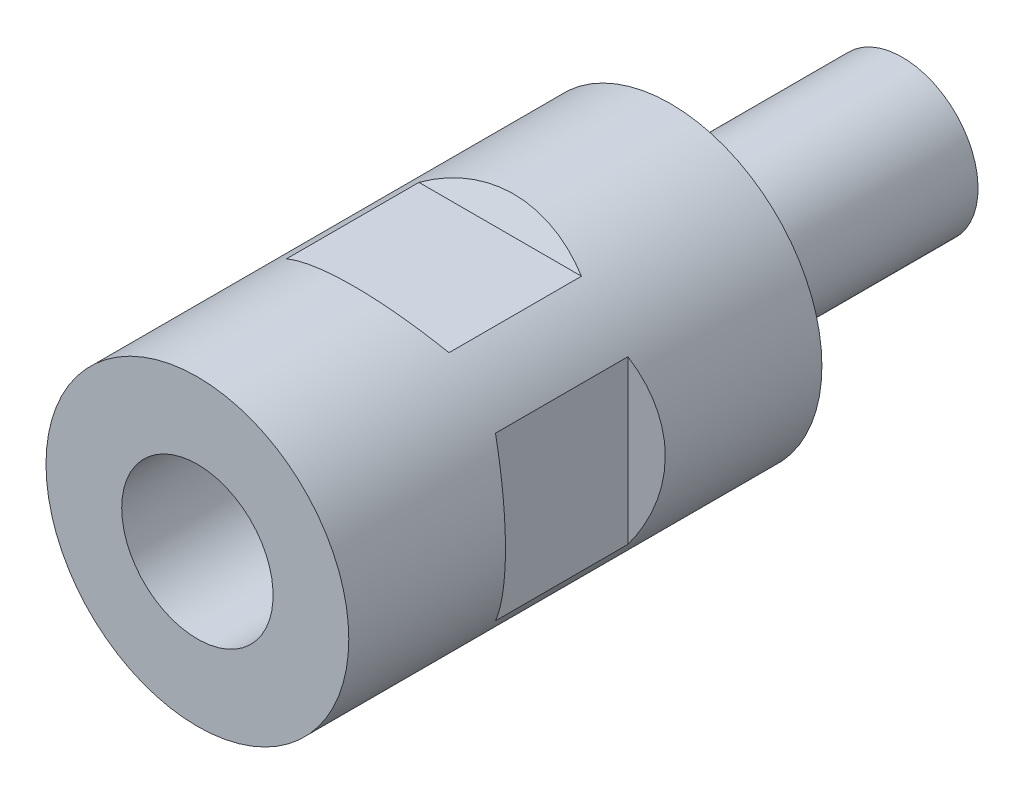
ISO-10303-21;
HEADER;
FILE_DESCRIPTION(('STEP AP214'),'2;1');
FILE_NAME('part.step','',(''),(''),'','','');
FILE_SCHEMA(('AUTOMOTIVE_DESIGN { 1 0 10303 214 1 1 1 1 }'));
ENDSEC;
DATA;
#1=APPLICATION_CONTEXT('core data for automotive mechanical design processes');
#2=APPLICATION_PROTOCOL_DEFINITION('international standard','automotive_design',2000,#1);
#3=PRODUCT_CONTEXT('',#1,'mechanical');
#4=PRODUCT('Part','Part','',(#3));
#5=PRODUCT_RELATED_PRODUCT_CATEGORY('part','',(#4));
#6=PRODUCT_DEFINITION_FORMATION('','',#4);
#7=PRODUCT_DEFINITION_CONTEXT('part definition',#1,'design');
#8=PRODUCT_DEFINITION('design','',#6,#7);
#9=PRODUCT_DEFINITION_SHAPE('','',#8);
#10=(LENGTH_UNIT() NAMED_UNIT(*) SI_UNIT(.MILLI.,.METRE.));
#11=(NAMED_UNIT(*) PLANE_ANGLE_UNIT() SI_UNIT($,.RADIAN.));
#12=(NAMED_UNIT(*) SI_UNIT($,.STERADIAN.) SOLID_ANGLE_UNIT());
#13=UNCERTAINTY_MEASURE_WITH_UNIT(LENGTH_MEASURE(1.E-05),#10,'distance_accuracy_value','');
#14=(GEOMETRIC_REPRESENTATION_CONTEXT(3) GLOBAL_UNCERTAINTY_ASSIGNED_CONTEXT((#13)) GLOBAL_UNIT_ASSIGNED_CONTEXT((#10,
#11,#12)) REPRESENTATION_CONTEXT('',''));
#15=CARTESIAN_POINT('',(0.,0.,0.));
#16=DIRECTION('',(0.,0.,1.));
#17=DIRECTION('',(1.,0.,0.));
#18=AXIS2_PLACEMENT_3D('',#15,#16,#17);
#19=CARTESIAN_POINT('',(0.,0.,-24.5));
#20=DIRECTION('',(0.,0.,1.));
#21=DIRECTION('',(0.,-1.,0.));
#22=AXIS2_PLACEMENT_3D('',#19,#20,#21);
#23=PLANE('',#22);
#24=CARTESIAN_POINT('',(0.,0.,-24.5));
#25=DIRECTION('',(0.,0.,1.));
#26=DIRECTION('',(0.,-1.,0.));
#27=AXIS2_PLACEMENT_3D('',#24,#25,#26);
#28=CIRCLE('',#27,8.);
#29=CARTESIAN_POINT('',(0.,-8.,-24.5));
#30=VERTEX_POINT('',#29);
#31=EDGE_CURVE('E17',#30,#30,#28,.F.);
#32=ORIENTED_EDGE('',*,*,#31,.T.);
#33=EDGE_LOOP('',(#32));
#34=FACE_BOUND('',#33,.T.);
#35=ADVANCED_FACE('F14',(#34),#23,.F.);
#36=CARTESIAN_POINT('',(0.,0.,-4.5));
#37=DIRECTION('',(0.,0.,1.));
#38=DIRECTION('',(0.,-1.,0.));
#39=AXIS2_PLACEMENT_3D('',#36,#37,#38);
#40=CYLINDRICAL_SURFACE('',#39,8.);
#41=CARTESIAN_POINT('',(0.,0.,0.));
#42=DIRECTION('',(0.,0.,-1.));
#43=DIRECTION('',(-1.,0.,0.));
#44=AXIS2_PLACEMENT_3D('',#41,#42,#43);
#45=CIRCLE('',#44,8.);
#46=CARTESIAN_POINT('',(-8.,0.,0.));
#47=VERTEX_POINT('',#46);
#48=EDGE_CURVE('E9',#47,#47,#45,.T.);
#49=ORIENTED_EDGE('',*,*,#48,.T.);
#50=EDGE_LOOP('',(#49));
#51=FACE_BOUND('',#50,.T.);
#52=ORIENTED_EDGE('',*,*,#31,.F.);
#53=EDGE_LOOP('',(#52));
#54=FACE_BOUND('',#53,.T.);
#55=ADVANCED_FACE('F113',(#51,#54),#40,.T.);
#56=CARTESIAN_POINT('',(0.,-8.,15.5));
#57=DIRECTION('',(0.,0.,-1.));
#58=DIRECTION('',(0.,1.,0.));
#59=AXIS2_PLACEMENT_3D('',#56,#57,#58);
#60=PLANE('',#59);
#61=CARTESIAN_POINT('',(0.,0.,15.5));
#62=DIRECTION('',(0.,0.,1.));
#63=DIRECTION('',(0.,-1.,0.));
#64=AXIS2_PLACEMENT_3D('',#61,#62,#63);
#65=CIRCLE('',#64,8.);
#66=CARTESIAN_POINT('',(0.,-8.,15.5));
#67=VERTEX_POINT('',#66);
#68=EDGE_CURVE('E103',#67,#67,#65,.T.);
#69=ORIENTED_EDGE('',*,*,#68,.T.);
#70=EDGE_LOOP('',(#69));
#71=FACE_BOUND('',#70,.T.);
#72=ADVANCED_FACE('F115',(#71),#60,.F.);
#73=CARTESIAN_POINT('',(13.5,-16.,32.));
#74=DIRECTION('',(-0.5,0.,0.86602540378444));
#75=DIRECTION('',(0.86602540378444,0.,0.5));
#76=AXIS2_PLACEMENT_3D('',#73,#74,#75);
#77=PLANE('',#76);
#78=DIRECTION('',(0.,1.,0.));
#79=VECTOR('',#78,1.);
#80=CARTESIAN_POINT('',(13.5,-16.,32.));
#81=LINE('',#80,#79);
#82=CARTESIAN_POINT('',(13.5,-8.58778201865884,32.));
#83=VERTEX_POINT('',#82);
#84=CARTESIAN_POINT('',(13.5,8.58778201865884,32.));
#85=VERTEX_POINT('',#84);
#86=EDGE_CURVE('E191',#83,#85,#81,.T.);
#87=ORIENTED_EDGE('',*,*,#86,.T.);
#88=CARTESIAN_POINT('',(0.,0.,24.2057713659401));
#89=DIRECTION('',(-0.5,0.,0.86602540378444));
#90=DIRECTION('',(-0.86602540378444,0.,-0.5));
#91=AXIS2_PLACEMENT_3D('',#88,#89,#90);
#92=ELLIPSE('',#91,18.475208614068,16.);
#93=EDGE_CURVE('E35',#83,#85,#92,.T.);
#94=ORIENTED_EDGE('',*,*,#93,.F.);
#95=EDGE_LOOP('',(#87,#94));
#96=FACE_BOUND('',#95,.T.);
#97=ADVANCED_FACE('F123',(#96),#77,.F.);
#98=CARTESIAN_POINT('',(13.5,-16.,32.));
#99=DIRECTION('',(-1.,0.,0.));
#100=DIRECTION('',(0.,0.,1.));
#101=AXIS2_PLACEMENT_3D('',#98,#99,#100);
#102=PLANE('',#101);
#103=ORIENTED_EDGE('',*,*,#86,.F.);
#104=DIRECTION('',(0.,0.,-1.));
#105=VECTOR('',#104,1.);
#106=CARTESIAN_POINT('',(13.5,-8.58778201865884,50.));
#107=LINE('',#106,#105);
#108=CARTESIAN_POINT('',(13.5,-8.58778201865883,18.));
#109=VERTEX_POINT('',#108);
#110=EDGE_CURVE('E199',#109,#83,#107,.F.);
#111=ORIENTED_EDGE('',*,*,#110,.F.);
#112=DIRECTION('',(0.,1.,0.));
#113=VECTOR('',#112,1.);
#114=CARTESIAN_POINT('',(13.5,-16.,18.));
#115=LINE('',#114,#113);
#116=CARTESIAN_POINT('',(13.5,8.58778201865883,18.));
#117=VERTEX_POINT('',#116);
#118=EDGE_CURVE('E195',#109,#117,#115,.T.);
#119=ORIENTED_EDGE('',*,*,#118,.T.);
#120=DIRECTION('',(0.,0.,-1.));
#121=VECTOR('',#120,1.);
#122=CARTESIAN_POINT('',(13.5,8.58778201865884,50.));
#123=LINE('',#122,#121);
#124=EDGE_CURVE('E29',#85,#117,#123,.T.);
#125=ORIENTED_EDGE('',*,*,#124,.F.);
#126=EDGE_LOOP('',(#103,#111,#119,#125));
#127=FACE_BOUND('',#126,.T.);
#128=ADVANCED_FACE('F182',(#127),#102,.F.);
#129=CARTESIAN_POINT('',(13.5,-16.,18.));
#130=DIRECTION('',(-0.5,0.,-0.866025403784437));
#131=DIRECTION('',(-0.866025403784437,0.,0.5));
#132=AXIS2_PLACEMENT_3D('',#129,#130,#131);
#133=PLANE('',#132);
#134=CARTESIAN_POINT('',(0.,0.,25.79422863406));
#135=DIRECTION('',(-0.5,0.,-0.866025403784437));
#136=DIRECTION('',(0.866025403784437,0.,-0.5));
#137=AXIS2_PLACEMENT_3D('',#134,#135,#136);
#138=ELLIPSE('',#137,18.475208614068,16.);
#139=EDGE_CURVE('E203',#117,#109,#138,.T.);
#140=ORIENTED_EDGE('',*,*,#139,.F.);
#141=ORIENTED_EDGE('',*,*,#118,.F.);
#142=EDGE_LOOP('',(#140,#141));
#143=FACE_BOUND('',#142,.T.);
#144=ADVANCED_FACE('F177',(#143),#133,.F.);
#145=CARTESIAN_POINT('',(-13.5,-16.,18.));
#146=DIRECTION('',(0.5,0.,-0.866025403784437));
#147=DIRECTION('',(-0.866025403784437,0.,-0.5));
#148=AXIS2_PLACEMENT_3D('',#145,#146,#147);
#149=PLANE('',#148);
#150=CARTESIAN_POINT('',(0.,0.,25.7942286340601));
#151=DIRECTION('',(0.5,0.,-0.866025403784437));
#152=DIRECTION('',(-0.866025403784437,0.,-0.5));
#153=AXIS2_PLACEMENT_3D('',#150,#151,#152);
#154=ELLIPSE('',#153,18.475208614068,16.);
#155=CARTESIAN_POINT('',(-13.5,-8.58778201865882,18.));
#156=VERTEX_POINT('',#155);
#157=CARTESIAN_POINT('',(-13.5,8.58778201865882,18.));
#158=VERTEX_POINT('',#157);
#159=EDGE_CURVE('E201',#156,#158,#154,.T.);
#160=ORIENTED_EDGE('',*,*,#159,.F.);
#161=DIRECTION('',(0.,1.,0.));
#162=VECTOR('',#161,1.);
#163=CARTESIAN_POINT('',(-13.5,-16.,18.));
#164=LINE('',#163,#162);
#165=EDGE_CURVE('E235',#156,#158,#164,.T.);
#166=ORIENTED_EDGE('',*,*,#165,.T.);
#167=EDGE_LOOP('',(#160,#166));
#168=FACE_BOUND('',#167,.T.);
#169=ADVANCED_FACE('F170',(#168),#149,.F.);
#170=CARTESIAN_POINT('',(-13.5,-16.,32.));
#171=DIRECTION('',(0.5,0.,0.866025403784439));
#172=DIRECTION('',(0.866025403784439,0.,-0.5));
#173=AXIS2_PLACEMENT_3D('',#170,#171,#172);
#174=PLANE('',#173);
#175=DIRECTION('',(0.,1.,0.));
#176=VECTOR('',#175,1.);
#177=CARTESIAN_POINT('',(-13.5,-16.,32.));
#178=LINE('',#177,#176);
#179=CARTESIAN_POINT('',(-13.5,-8.58778201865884,32.));
#180=VERTEX_POINT('',#179);
#181=CARTESIAN_POINT('',(-13.5,8.58778201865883,32.));
#182=VERTEX_POINT('',#181);
#183=EDGE_CURVE('E239',#180,#182,#178,.T.);
#184=ORIENTED_EDGE('',*,*,#183,.F.);
#185=CARTESIAN_POINT('',(0.,0.,24.2057713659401));
#186=DIRECTION('',(0.5,0.,0.866025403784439));
#187=DIRECTION('',(0.866025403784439,0.,-0.5));
#188=AXIS2_PLACEMENT_3D('',#185,#186,#187);
#189=ELLIPSE('',#188,18.475208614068,16.);
#190=EDGE_CURVE('E214',#182,#180,#189,.T.);
#191=ORIENTED_EDGE('',*,*,#190,.F.);
#192=EDGE_LOOP('',(#184,#191));
#193=FACE_BOUND('',#192,.T.);
#194=ADVANCED_FACE('F171',(#193),#174,.F.);
#195=CARTESIAN_POINT('',(-13.5,-16.,32.));
#196=DIRECTION('',(1.,0.,0.));
#197=DIRECTION('',(0.,0.,-1.));
#198=AXIS2_PLACEMENT_3D('',#195,#196,#197);
#199=PLANE('',#198);
#200=ORIENTED_EDGE('',*,*,#183,.T.);
#201=DIRECTION('',(0.,0.,-1.));
#202=VECTOR('',#201,1.);
#203=CARTESIAN_POINT('',(-13.5,8.58778201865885,50.));
#204=LINE('',#203,#202);
#205=EDGE_CURVE('E208',#158,#182,#204,.F.);
#206=ORIENTED_EDGE('',*,*,#205,.F.);
#207=ORIENTED_EDGE('',*,*,#165,.F.);
#208=DIRECTION('',(0.,0.,-1.));
#209=VECTOR('',#208,1.);
#210=CARTESIAN_POINT('',(-13.5,-8.58778201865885,50.));
#211=LINE('',#210,#209);
#212=EDGE_CURVE('E211',#180,#156,#211,.T.);
#213=ORIENTED_EDGE('',*,*,#212,.F.);
#214=EDGE_LOOP('',(#200,#206,#207,#213));
#215=FACE_BOUND('',#214,.T.);
#216=ADVANCED_FACE('F168',(#215),#199,.F.);
#217=CARTESIAN_POINT('',(16.,13.5,32.));
#218=DIRECTION('',(0.,-0.5,0.86602540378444));
#219=DIRECTION('',(0.,-0.86602540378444,-0.5));
#220=AXIS2_PLACEMENT_3D('',#217,#218,#219);
#221=PLANE('',#220);
#222=DIRECTION('',(-1.,0.,0.));
#223=VECTOR('',#222,1.);
#224=CARTESIAN_POINT('',(16.,13.5,32.));
#225=LINE('',#224,#223);
#226=CARTESIAN_POINT('',(8.58778201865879,13.5,32.));
#227=VERTEX_POINT('',#226);
#228=CARTESIAN_POINT('',(-8.58778201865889,13.5,32.));
#229=VERTEX_POINT('',#228);
#230=EDGE_CURVE('E233',#227,#229,#225,.T.);
#231=ORIENTED_EDGE('',*,*,#230,.T.);
#232=CARTESIAN_POINT('',(0.,0.,24.2057713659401));
#233=DIRECTION('',(0.,-0.5,0.86602540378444));
#234=DIRECTION('',(0.,-0.86602540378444,-0.5));
#235=AXIS2_PLACEMENT_3D('',#232,#233,#234);
#236=ELLIPSE('',#235,18.475208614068,16.);
#237=EDGE_CURVE('E222',#227,#229,#236,.T.);
#238=ORIENTED_EDGE('',*,*,#237,.F.);
#239=EDGE_LOOP('',(#231,#238));
#240=FACE_BOUND('',#239,.T.);
#241=ADVANCED_FACE('F163',(#240),#221,.F.);
#242=CARTESIAN_POINT('',(16.,13.5,32.));
#243=DIRECTION('',(0.,-1.,0.));
#244=DIRECTION('',(1.,0.,0.));
#245=AXIS2_PLACEMENT_3D('',#242,#243,#244);
#246=PLANE('',#245);
#247=ORIENTED_EDGE('',*,*,#230,.F.);
#248=DIRECTION('',(0.,0.,-1.));
#249=VECTOR('',#248,1.);
#250=CARTESIAN_POINT('',(8.58778201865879,13.5,50.));
#251=LINE('',#250,#249);
#252=CARTESIAN_POINT('',(8.58778201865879,13.5,18.));
#253=VERTEX_POINT('',#252);
#254=EDGE_CURVE('E88',#253,#227,#251,.F.);
#255=ORIENTED_EDGE('',*,*,#254,.F.);
#256=DIRECTION('',(-1.,0.,0.));
#257=VECTOR('',#256,1.);
#258=CARTESIAN_POINT('',(16.,13.5,18.));
#259=LINE('',#258,#257);
#260=CARTESIAN_POINT('',(-8.58778201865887,13.5,18.));
#261=VERTEX_POINT('',#260);
#262=EDGE_CURVE('E231',#253,#261,#259,.T.);
#263=ORIENTED_EDGE('',*,*,#262,.T.);
#264=DIRECTION('',(0.,0.,-1.));
#265=VECTOR('',#264,1.);
#266=CARTESIAN_POINT('',(-8.58778201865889,13.5,50.));
#267=LINE('',#266,#265);
#268=EDGE_CURVE('E219',#229,#261,#267,.T.);
#269=ORIENTED_EDGE('',*,*,#268,.F.);
#270=EDGE_LOOP('',(#247,#255,#263,#269));
#271=FACE_BOUND('',#270,.T.);
#272=ADVANCED_FACE('F156',(#271),#246,.F.);
#273=CARTESIAN_POINT('',(16.,13.5,18.));
#274=DIRECTION('',(0.,-0.5,-0.866025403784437));
#275=DIRECTION('',(0.,0.866025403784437,-0.5));
#276=AXIS2_PLACEMENT_3D('',#273,#274,#275);
#277=PLANE('',#276);
#278=CARTESIAN_POINT('',(0.,0.,25.79422863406));
#279=DIRECTION('',(0.,-0.5,-0.866025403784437));
#280=DIRECTION('',(0.,0.866025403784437,-0.5));
#281=AXIS2_PLACEMENT_3D('',#278,#279,#280);
#282=ELLIPSE('',#281,18.475208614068,16.);
#283=EDGE_CURVE('E217',#261,#253,#282,.T.);
#284=ORIENTED_EDGE('',*,*,#283,.F.);
#285=ORIENTED_EDGE('',*,*,#262,.F.);
#286=EDGE_LOOP('',(#284,#285));
#287=FACE_BOUND('',#286,.T.);
#288=ADVANCED_FACE('F147',(#287),#277,.F.);
#289=CARTESIAN_POINT('',(16.,-13.5,18.));
#290=DIRECTION('',(0.,0.5,-0.866025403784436));
#291=DIRECTION('',(0.,0.866025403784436,0.5));
#292=AXIS2_PLACEMENT_3D('',#289,#290,#291);
#293=PLANE('',#292);
#294=CARTESIAN_POINT('',(0.,0.,25.7942286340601));
#295=DIRECTION('',(0.,0.5,-0.866025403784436));
#296=DIRECTION('',(0.,-0.866025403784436,-0.5));
#297=AXIS2_PLACEMENT_3D('',#294,#295,#296);
#298=ELLIPSE('',#297,18.4752086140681,16.);
#299=CARTESIAN_POINT('',(8.58778201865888,-13.5,18.));
#300=VERTEX_POINT('',#299);
#301=CARTESIAN_POINT('',(-8.58778201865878,-13.5,18.));
#302=VERTEX_POINT('',#301);
#303=EDGE_CURVE('E79',#300,#302,#298,.T.);
#304=ORIENTED_EDGE('',*,*,#303,.F.);
#305=DIRECTION('',(-1.,0.,0.));
#306=VECTOR('',#305,1.);
#307=CARTESIAN_POINT('',(16.,-13.5,18.));
#308=LINE('',#307,#306);
#309=EDGE_CURVE('E82',#300,#302,#308,.T.);
#310=ORIENTED_EDGE('',*,*,#309,.T.);
#311=EDGE_LOOP('',(#304,#310));
#312=FACE_BOUND('',#311,.T.);
#313=ADVANCED_FACE('F81',(#312),#293,.F.);
#314=CARTESIAN_POINT('',(16.,-13.5,32.));
#315=DIRECTION('',(0.,0.5,0.866025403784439));
#316=DIRECTION('',(0.,-0.866025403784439,0.5));
#317=AXIS2_PLACEMENT_3D('',#314,#315,#316);
#318=PLANE('',#317);
#319=DIRECTION('',(-1.,0.,0.));
#320=VECTOR('',#319,1.);
#321=CARTESIAN_POINT('',(16.,-13.5,32.));
#322=LINE('',#321,#320);
#323=CARTESIAN_POINT('',(8.5877820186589,-13.5,32.));
#324=VERTEX_POINT('',#323);
#325=CARTESIAN_POINT('',(-8.58778201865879,-13.5,32.));
#326=VERTEX_POINT('',#325);
#327=EDGE_CURVE('E95',#324,#326,#322,.T.);
#328=ORIENTED_EDGE('',*,*,#327,.F.);
#329=CARTESIAN_POINT('',(0.,0.,24.2057713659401));
#330=DIRECTION('',(0.,0.5,0.866025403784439));
#331=DIRECTION('',(0.,0.866025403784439,-0.5));
#332=AXIS2_PLACEMENT_3D('',#329,#330,#331);
#333=ELLIPSE('',#332,18.475208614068,16.);
#334=EDGE_CURVE('E101',#326,#324,#333,.T.);
#335=ORIENTED_EDGE('',*,*,#334,.F.);
#336=EDGE_LOOP('',(#328,#335));
#337=FACE_BOUND('',#336,.T.);
#338=ADVANCED_FACE('F145',(#337),#318,.F.);
#339=CARTESIAN_POINT('',(16.,-13.5,32.));
#340=DIRECTION('',(0.,1.,0.));
#341=DIRECTION('',(-1.,0.,0.));
#342=AXIS2_PLACEMENT_3D('',#339,#340,#341);
#343=PLANE('',#342);
#344=ORIENTED_EDGE('',*,*,#327,.T.);
#345=DIRECTION('',(0.,0.,-1.));
#346=VECTOR('',#345,1.);
#347=CARTESIAN_POINT('',(-8.58778201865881,-13.5,50.));
#348=LINE('',#347,#346);
#349=EDGE_CURVE('E87',#302,#326,#348,.F.);
#350=ORIENTED_EDGE('',*,*,#349,.F.);
#351=ORIENTED_EDGE('',*,*,#309,.F.);
#352=DIRECTION('',(0.,0.,-1.));
#353=VECTOR('',#352,1.);
#354=CARTESIAN_POINT('',(8.5877820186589,-13.5,50.));
#355=LINE('',#354,#353);
#356=EDGE_CURVE('E93',#324,#300,#355,.T.);
#357=ORIENTED_EDGE('',*,*,#356,.F.);
#358=EDGE_LOOP('',(#344,#350,#351,#357));
#359=FACE_BOUND('',#358,.T.);
#360=ADVANCED_FACE('F92',(#359),#343,.F.);
#361=CARTESIAN_POINT('',(0.,0.,50.));
#362=DIRECTION('',(0.,0.,-1.));
#363=DIRECTION('',(-1.,0.,0.));
#364=AXIS2_PLACEMENT_3D('',#361,#362,#363);
#365=CYLINDRICAL_SURFACE('',#364,16.);
#366=ORIENTED_EDGE('',*,*,#349,.T.);
#367=ORIENTED_EDGE('',*,*,#334,.T.);
#368=ORIENTED_EDGE('',*,*,#356,.T.);
#369=ORIENTED_EDGE('',*,*,#303,.T.);
#370=EDGE_LOOP('',(#366,#367,#368,#369));
#371=FACE_BOUND('',#370,.T.);
#372=ORIENTED_EDGE('',*,*,#283,.T.);
#373=ORIENTED_EDGE('',*,*,#254,.T.);
#374=ORIENTED_EDGE('',*,*,#237,.T.);
#375=ORIENTED_EDGE('',*,*,#268,.T.);
#376=EDGE_LOOP('',(#372,#373,#374,#375));
#377=FACE_BOUND('',#376,.T.);
#378=ORIENTED_EDGE('',*,*,#205,.T.);
#379=ORIENTED_EDGE('',*,*,#190,.T.);
#380=ORIENTED_EDGE('',*,*,#212,.T.);
#381=ORIENTED_EDGE('',*,*,#159,.T.);
#382=EDGE_LOOP('',(#378,#379,#380,#381));
#383=FACE_BOUND('',#382,.T.);
#384=ORIENTED_EDGE('',*,*,#139,.T.);
#385=ORIENTED_EDGE('',*,*,#110,.T.);
#386=ORIENTED_EDGE('',*,*,#93,.T.);
#387=ORIENTED_EDGE('',*,*,#124,.T.);
#388=EDGE_LOOP('',(#384,#385,#386,#387));
#389=FACE_BOUND('',#388,.T.);
#390=CARTESIAN_POINT('',(0.,0.,50.));
#391=DIRECTION('',(0.,0.,1.));
#392=DIRECTION('',(1.,0.,0.));
#393=AXIS2_PLACEMENT_3D('',#390,#391,#392);
#394=CIRCLE('',#393,16.);
#395=CARTESIAN_POINT('',(16.,0.,50.));
#396=VERTEX_POINT('',#395);
#397=EDGE_CURVE('E247',#396,#396,#394,.T.);
#398=ORIENTED_EDGE('',*,*,#397,.F.);
#399=EDGE_LOOP('',(#398));
#400=FACE_BOUND('',#399,.T.);
#401=CARTESIAN_POINT('',(0.,0.,0.));
#402=DIRECTION('',(0.,0.,1.));
#403=DIRECTION('',(1.,0.,0.));
#404=AXIS2_PLACEMENT_3D('',#401,#402,#403);
#405=CIRCLE('',#404,16.);
#406=CARTESIAN_POINT('',(16.,0.,0.));
#407=VERTEX_POINT('',#406);
#408=EDGE_CURVE('E194',#407,#407,#405,.T.);
#409=ORIENTED_EDGE('',*,*,#408,.T.);
#410=EDGE_LOOP('',(#409));
#411=FACE_BOUND('',#410,.T.);
#412=ADVANCED_FACE('F99',(#371,#377,#383,#389,#400,#411),#365,.T.);
#413=CARTESIAN_POINT('',(0.,0.,0.));
#414=DIRECTION('',(0.,0.,1.));
#415=DIRECTION('',(1.,0.,0.));
#416=AXIS2_PLACEMENT_3D('',#413,#414,#415);
#417=PLANE('',#416);
#418=ORIENTED_EDGE('',*,*,#48,.F.);
#419=EDGE_LOOP('',(#418));
#420=FACE_BOUND('',#419,.T.);
#421=ORIENTED_EDGE('',*,*,#408,.F.);
#422=EDGE_LOOP('',(#421));
#423=FACE_BOUND('',#422,.T.);
#424=ADVANCED_FACE('F127',(#420,#423),#417,.F.);
#425=CARTESIAN_POINT('',(0.,0.,50.));
#426=DIRECTION('',(0.,0.,1.));
#427=DIRECTION('',(1.,0.,0.));
#428=AXIS2_PLACEMENT_3D('',#425,#426,#427);
#429=PLANE('',#428);
#430=ORIENTED_EDGE('',*,*,#397,.T.);
#431=EDGE_LOOP('',(#430));
#432=FACE_BOUND('',#431,.T.);
#433=CARTESIAN_POINT('',(0.,0.,50.));
#434=DIRECTION('',(0.,0.,-1.));
#435=DIRECTION('',(-1.,0.,0.));
#436=AXIS2_PLACEMENT_3D('',#433,#434,#435);
#437=CIRCLE('',#436,8.);
#438=CARTESIAN_POINT('',(-8.,0.,50.));
#439=VERTEX_POINT('',#438);
#440=EDGE_CURVE('E96',#439,#439,#437,.T.);
#441=ORIENTED_EDGE('',*,*,#440,.T.);
#442=EDGE_LOOP('',(#441));
#443=FACE_BOUND('',#442,.T.);
#444=ADVANCED_FACE('F117',(#432,#443),#429,.T.);
#445=CARTESIAN_POINT('',(0.,0.,0.));
#446=DIRECTION('',(0.,0.,-1.));
#447=DIRECTION('',(-1.,0.,0.));
#448=AXIS2_PLACEMENT_3D('',#445,#446,#447);
#449=CYLINDRICAL_SURFACE('',#448,8.);
#450=ORIENTED_EDGE('',*,*,#68,.F.);
#451=EDGE_LOOP('',(#450));
#452=FACE_BOUND('',#451,.T.);
#453=ORIENTED_EDGE('',*,*,#440,.F.);
#454=EDGE_LOOP('',(#453));
#455=FACE_BOUND('',#454,.T.);
#456=ADVANCED_FACE('F125',(#452,#455),#449,.F.);
#457=CLOSED_SHELL('',(#35,#55,#72,#97,#128,#144,#169,#194,#216,#241,#272,#288,#313,#338,#360,
#412,#424,#444,#456));
#458=MANIFOLD_SOLID_BREP('B1',#457);
#459=ADVANCED_BREP_SHAPE_REPRESENTATION('',(#18,#458),#14);
#460=SHAPE_DEFINITION_REPRESENTATION(#9,#459);
ENDSEC;
END-ISO-10303-21;
